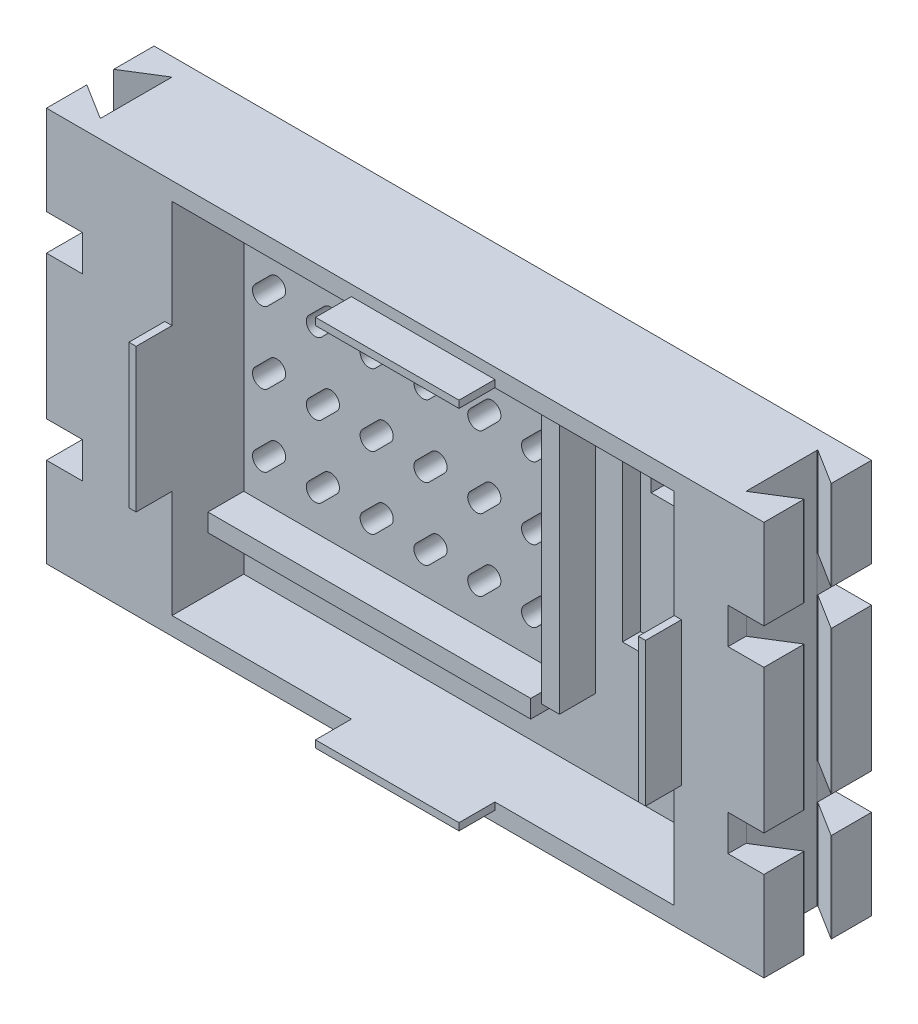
from build123d import *

# Parameters (mm, degrees)
SKETCH1_W            = 150
SKETCH1_H            = 110
BOSS_EXTRUDE1_DEPTH  = 30
SKETCH2_W            = 140
SKETCH2_H            = 100
CUT_EXTRUDE1_DEPTH   = 20
SKETCH3_W            = 90
SKETCH3_H            = 5
BOSS_EXTRUDE3_DEPTH  = 10
SKETCH4_W            = 5
SKETCH4_H            = 79.839205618
BOSS_EXTRUDE4_DEPTH  = 10
CUT_EXTRUDE3_DEPTH   = 30
SKETCH6_W            = 30
SKETCH6_H            = 110
BOSS_EXTRUDE5_DEPTH  = 20
CUT_EXTRUDE4_DEPTH   = 160
SKETCH8_W            = 30
SKETCH8_H            = 110
BOSS_EXTRUDE6_DEPTH  = 30
CUT_EXTRUDE5_DEPTH   = 120
FILLET5_R            = 0.1
FILLET6_R            = 0.1
FILLET7_R            = 0.1
FILLET8_R            = 0.1
SKETCH21_W           = 25.5
SKETCH21_H           = 25
CUT_EXTRUDE10_DEPTH  = 5
SKETCH22_W           = 19.5
SKETCH22_H           = 25
CUT_EXTRUDE11_DEPTH  = 5
SKETCH23_W           = 21.5
SKETCH23_H           = 35
CUT_EXTRUDE12_DEPTH  = 5
SKETCH28_W           = 40
SKETCH28_H           = 2
BOSS_EXTRUDE8_DEPTH  = 10
SKETCH29_W           = 2
SKETCH29_H           = 40
BOSS_EXTRUDE9_DEPTH  = 10
SKETCH30_W           = 25.5
SKETCH30_H           = 60
CUT_EXTRUDE13_DEPTH  = 5
SKETCH32_W           = 3.5
SKETCH32_H           = 4
BOSS_EXTRUDE10_DEPTH = 2.5
SKETCH33_W           = 3.5
SKETCH33_H           = 4
BOSS_EXTRUDE11_DEPTH = 2.5
SKETCH34_W           = 10
SKETCH34_H           = 10
CUT_EXTRUDE14_DEPTH  = 42.5
SKETCH35_W           = 10
SKETCH35_H           = 10
CUT_EXTRUDE15_DEPTH  = 42.5


with BuildPart() as part:
    # Sketch1 → Boss-Extrude1 (new body)
    with BuildSketch(Plane.XY):
        with Locations((75, -55)):
            Rectangle(SKETCH1_W, SKETCH1_H)
    extrude(amount=BOSS_EXTRUDE1_DEPTH)

    # Sketch2 → Cut-Extrude1 (cut)
    with BuildSketch(Plane.XY.offset(30)):
        with Locations((75, -55)):
            Rectangle(SKETCH2_W, SKETCH2_H)
    extrude(amount=-CUT_EXTRUDE1_DEPTH, mode=Mode.SUBTRACT)

    # Sketch3 → Boss-Extrude3 (add)
    with BuildSketch(Plane.XY.offset(10)):
        with Locations((50, -87.5)):
            Rectangle(SKETCH3_W, SKETCH3_H)
    extrude(amount=BOSS_EXTRUDE3_DEPTH)

    # Sketch4 → Boss-Extrude4 (add)
    with BuildSketch(Plane.XY.offset(10)):
        with Locations((100.5, -44.919602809)):
            Rectangle(SKETCH4_W, SKETCH4_H)
    extrude(amount=BOSS_EXTRUDE4_DEPTH)

    # Sketch5 → Cut-Extrude3 (cut)
    with BuildSketch(Plane.XY.offset(10)):
        with BuildLine():
            Line((8.162282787, -13.401513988), (12.404923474, -9.158873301))
            ThreePointArc((12.404923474, -9.158873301), (15.94045738, -9.158873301), (15.94045738, -12.694407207))
            Line((15.94045738, -12.694407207), (11.697816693, -16.937047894))
            ThreePointArc((11.697816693, -16.937047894), (8.162282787, -16.937047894), (8.162282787, -13.401513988))
        make_face()
        with BuildLine():
            Line((23.162282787, -13.401513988), (27.404923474, -9.158873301))
            ThreePointArc((27.404923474, -9.158873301), (30.94045738, -9.158873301), (30.94045738, -12.694407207))
            Line((30.94045738, -12.694407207), (26.697816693, -16.937047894))
            ThreePointArc((26.697816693, -16.937047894), (23.162282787, -16.937047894), (23.162282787, -13.401513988))
        make_face()
        with BuildLine():
            Line((38.162282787, -13.401513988), (42.404923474, -9.158873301))
            ThreePointArc((42.404923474, -9.158873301), (45.94045738, -9.158873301), (45.94045738, -12.694407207))
            Line((45.94045738, -12.694407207), (41.697816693, -16.937047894))
            ThreePointArc((41.697816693, -16.937047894), (38.162282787, -16.937047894), (38.162282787, -13.401513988))
        make_face()
        with BuildLine():
            Line((53.162282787, -13.401513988), (57.404923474, -9.158873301))
            ThreePointArc((57.404923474, -9.158873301), (60.94045738, -9.158873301), (60.94045738, -12.694407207))
            Line((60.94045738, -12.694407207), (56.697816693, -16.937047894))
            ThreePointArc((56.697816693, -16.937047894), (53.162282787, -16.937047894), (53.162282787, -13.401513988))
        make_face()
        with BuildLine():
            Line((68.162282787, -13.401513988), (72.404923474, -9.158873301))
            ThreePointArc((72.404923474, -9.158873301), (75.94045738, -9.158873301), (75.94045738, -12.694407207))
            Line((75.94045738, -12.694407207), (71.697816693, -16.937047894))
            ThreePointArc((71.697816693, -16.937047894), (68.162282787, -16.937047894), (68.162282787, -13.401513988))
        make_face()
        with BuildLine():
            Line((83.162282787, -13.401513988), (87.404923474, -9.158873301))
            ThreePointArc((87.404923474, -9.158873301), (90.94045738, -9.158873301), (90.94045738, -12.694407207))
            Line((90.94045738, -12.694407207), (86.697816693, -16.937047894))
            ThreePointArc((86.697816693, -16.937047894), (83.162282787, -16.937047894), (83.162282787, -13.401513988))
        make_face()
        with BuildLine():
            Line((23.162282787, -33.401513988), (27.404923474, -29.158873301))
            ThreePointArc((27.404923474, -29.158873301), (30.94045738, -29.158873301), (30.94045738, -32.694407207))
            Line((30.94045738, -32.694407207), (26.697816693, -36.937047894))
            ThreePointArc((26.697816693, -36.937047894), (23.162282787, -36.937047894), (23.162282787, -33.401513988))
        make_face()
        with BuildLine():
            Line((38.162282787, -33.401513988), (42.404923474, -29.158873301))
            ThreePointArc((42.404923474, -29.158873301), (45.94045738, -29.158873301), (45.94045738, -32.694407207))
            Line((45.94045738, -32.694407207), (41.697816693, -36.937047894))
            ThreePointArc((41.697816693, -36.937047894), (38.162282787, -36.937047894), (38.162282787, -33.401513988))
        make_face()
        with BuildLine():
            Line((53.162282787, -33.401513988), (57.404923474, -29.158873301))
            ThreePointArc((57.404923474, -29.158873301), (60.94045738, -29.158873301), (60.94045738, -32.694407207))
            Line((60.94045738, -32.694407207), (56.697816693, -36.937047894))
            ThreePointArc((56.697816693, -36.937047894), (53.162282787, -36.937047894), (53.162282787, -33.401513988))
        make_face()
        with BuildLine():
            Line((68.162282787, -33.401513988), (72.404923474, -29.158873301))
            ThreePointArc((72.404923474, -29.158873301), (75.94045738, -29.158873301), (75.94045738, -32.694407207))
            Line((75.94045738, -32.694407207), (71.697816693, -36.937047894))
            ThreePointArc((71.697816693, -36.937047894), (68.162282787, -36.937047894), (68.162282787, -33.401513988))
        make_face()
        with BuildLine():
            Line((83.162282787, -33.401513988), (87.404923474, -29.158873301))
            ThreePointArc((87.404923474, -29.158873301), (90.94045738, -29.158873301), (90.94045738, -32.694407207))
            Line((90.94045738, -32.694407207), (86.697816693, -36.937047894))
            ThreePointArc((86.697816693, -36.937047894), (83.162282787, -36.937047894), (83.162282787, -33.401513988))
        make_face()
        with BuildLine():
            Line((23.162282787, -53.401513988), (27.404923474, -49.158873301))
            ThreePointArc((27.404923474, -49.158873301), (30.94045738, -49.158873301), (30.94045738, -52.694407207))
            Line((30.94045738, -52.694407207), (26.697816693, -56.937047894))
            ThreePointArc((26.697816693, -56.937047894), (23.162282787, -56.937047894), (23.162282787, -53.401513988))
        make_face()
        with BuildLine():
            Line((38.162282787, -53.401513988), (42.404923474, -49.158873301))
            ThreePointArc((42.404923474, -49.158873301), (45.94045738, -49.158873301), (45.94045738, -52.694407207))
            Line((45.94045738, -52.694407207), (41.697816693, -56.937047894))
            ThreePointArc((41.697816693, -56.937047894), (38.162282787, -56.937047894), (38.162282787, -53.401513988))
        make_face()
        with BuildLine():
            Line((53.162282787, -53.401513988), (57.404923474, -49.158873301))
            ThreePointArc((57.404923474, -49.158873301), (60.94045738, -49.158873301), (60.94045738, -52.694407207))
            Line((60.94045738, -52.694407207), (56.697816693, -56.937047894))
            ThreePointArc((56.697816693, -56.937047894), (53.162282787, -56.937047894), (53.162282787, -53.401513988))
        make_face()
        with BuildLine():
            Line((68.162282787, -53.401513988), (72.404923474, -49.158873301))
            ThreePointArc((72.404923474, -49.158873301), (75.94045738, -49.158873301), (75.94045738, -52.694407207))
            Line((75.94045738, -52.694407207), (71.697816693, -56.937047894))
            ThreePointArc((71.697816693, -56.937047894), (68.162282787, -56.937047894), (68.162282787, -53.401513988))
        make_face()
        with BuildLine():
            Line((83.162282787, -53.401513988), (87.404923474, -49.158873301))
            ThreePointArc((87.404923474, -49.158873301), (90.94045738, -49.158873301), (90.94045738, -52.694407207))
            Line((90.94045738, -52.694407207), (86.697816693, -56.937047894))
            ThreePointArc((86.697816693, -56.937047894), (83.162282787, -56.937047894), (83.162282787, -53.401513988))
        make_face()
        with BuildLine():
            Line((23.162282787, -73.401513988), (27.404923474, -69.158873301))
            ThreePointArc((27.404923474, -69.158873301), (30.94045738, -69.158873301), (30.94045738, -72.694407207))
            Line((30.94045738, -72.694407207), (26.697816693, -76.937047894))
            ThreePointArc((26.697816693, -76.937047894), (23.162282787, -76.937047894), (23.162282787, -73.401513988))
        make_face()
        with BuildLine():
            Line((38.162282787, -73.401513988), (42.404923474, -69.158873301))
            ThreePointArc((42.404923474, -69.158873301), (45.94045738, -69.158873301), (45.94045738, -72.694407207))
            Line((45.94045738, -72.694407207), (41.697816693, -76.937047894))
            ThreePointArc((41.697816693, -76.937047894), (38.162282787, -76.937047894), (38.162282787, -73.401513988))
        make_face()
        with BuildLine():
            Line((53.162282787, -73.401513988), (57.404923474, -69.158873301))
            ThreePointArc((57.404923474, -69.158873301), (60.94045738, -69.158873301), (60.94045738, -72.694407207))
            Line((60.94045738, -72.694407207), (56.697816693, -76.937047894))
            ThreePointArc((56.697816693, -76.937047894), (53.162282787, -76.937047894), (53.162282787, -73.401513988))
        make_face()
        with BuildLine():
            Line((68.162282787, -73.401513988), (72.404923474, -69.158873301))
            ThreePointArc((72.404923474, -69.158873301), (75.94045738, -69.158873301), (75.94045738, -72.694407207))
            Line((75.94045738, -72.694407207), (71.697816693, -76.937047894))
            ThreePointArc((71.697816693, -76.937047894), (68.162282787, -76.937047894), (68.162282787, -73.401513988))
        make_face()
        with BuildLine():
            Line((83.162282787, -73.401513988), (87.404923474, -69.158873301))
            ThreePointArc((87.404923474, -69.158873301), (90.94045738, -69.158873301), (90.94045738, -72.694407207))
            Line((90.94045738, -72.694407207), (86.697816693, -76.937047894))
            ThreePointArc((86.697816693, -76.937047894), (83.162282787, -76.937047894), (83.162282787, -73.401513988))
        make_face()
        with BuildLine():
            Line((8.162282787, -33.401513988), (12.404923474, -29.158873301))
            ThreePointArc((12.404923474, -29.158873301), (15.94045738, -29.158873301), (15.94045738, -32.694407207))
            Line((15.94045738, -32.694407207), (11.697816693, -36.937047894))
            ThreePointArc((11.697816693, -36.937047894), (8.162282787, -36.937047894), (8.162282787, -33.401513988))
        make_face()
        with BuildLine():
            Line((8.162282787, -53.401513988), (12.404923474, -49.158873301))
            ThreePointArc((12.404923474, -49.158873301), (15.94045738, -49.158873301), (15.94045738, -52.694407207))
            Line((15.94045738, -52.694407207), (11.697816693, -56.937047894))
            ThreePointArc((11.697816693, -56.937047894), (8.162282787, -56.937047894), (8.162282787, -53.401513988))
        make_face()
        with BuildLine():
            Line((8.162282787, -73.401513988), (12.404923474, -69.158873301))
            ThreePointArc((12.404923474, -69.158873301), (15.94045738, -69.158873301), (15.94045738, -72.694407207))
            Line((15.94045738, -72.694407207), (11.697816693, -76.937047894))
            ThreePointArc((11.697816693, -76.937047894), (8.162282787, -76.937047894), (8.162282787, -73.401513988))
        make_face()
    extrude(amount=-CUT_EXTRUDE3_DEPTH, mode=Mode.SUBTRACT)

    # Sketch6 → Boss-Extrude5 (add)
    with BuildSketch(Plane(origin=(150, 0, 0), x_dir=(0, 0, -1), z_dir=(1, 0, 0))):
        with Locations((-15, -55)):
            Rectangle(SKETCH6_W, SKETCH6_H)
    extrude(amount=BOSS_EXTRUDE5_DEPTH)

    # Sketch7 → Cut-Extrude4 (cut)
    with BuildSketch(Plane.XZ.offset(110)):
        Polygon((170, 18.75), (159.997909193, 25), (159.997909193, 5), (170, 11.25), align=None)
    extrude(amount=-CUT_EXTRUDE4_DEPTH, mode=Mode.SUBTRACT)

    # Sketch8 → Boss-Extrude6 (add)
    with BuildSketch(Plane.ZY):
        with Locations((15, -55)):
            Rectangle(SKETCH8_W, SKETCH8_H)
    extrude(amount=BOSS_EXTRUDE6_DEPTH)

    # Sketch9 → Cut-Extrude5 (cut)
    with BuildSketch(Plane.XZ.offset(110)):
        Polygon((-30, 11.25), (-30, 18.75), (-19.997909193, 25), (-19.997909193, 5), align=None)
    extrude(amount=-CUT_EXTRUDE5_DEPTH, mode=Mode.SUBTRACT)

    # Fillet5
    fillet5_edges = [part.edges().sort_by_distance(p)[0] for p in [
        (-19.997909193, -55, 5),
    ]]
    fillet(fillet5_edges, radius=FILLET5_R)

    # Fillet6
    fillet6_edges = [part.edges().sort_by_distance(p)[0] for p in [
        (-19.997909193, -55, 25),
    ]]
    fillet(fillet6_edges, radius=FILLET6_R)

    # Fillet7
    fillet7_edges = [part.edges().sort_by_distance(p)[0] for p in [
        (159.997909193, -55, 5),
        (159.997909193, -55, 25),
    ]]
    fillet(fillet7_edges, radius=FILLET7_R)

    # Fillet8
    fillet8_edges = [part.edges().sort_by_distance(p)[0] for p in [
        (170, -55, 18.75),
        (170, -55, 11.25),
    ]]
    fillet(fillet8_edges, radius=FILLET8_R)

    # Sketch21 → Cut-Extrude10 (cut)
    with BuildSketch(Plane.XY.offset(10)):
        with Locations((123.308603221, -21.083663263)):
            Rectangle(SKETCH21_W, SKETCH21_H)
    extrude(amount=-CUT_EXTRUDE10_DEPTH, mode=Mode.SUBTRACT)

    # Sketch22 → Cut-Extrude11 (cut)
    with BuildSketch(Plane.XY.offset(5)):
        with Locations((123.308603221, -21.083663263)):
            Rectangle(SKETCH22_W, SKETCH22_H)
    extrude(amount=-CUT_EXTRUDE11_DEPTH, mode=Mode.SUBTRACT)

    # Sketch23 → Cut-Extrude12 (cut)
    with BuildSketch(Plane.XY.offset(10)):
        with Locations((123.308603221, -51.083663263)):
            Rectangle(SKETCH23_W, SKETCH23_H)
    extrude(amount=-CUT_EXTRUDE12_DEPTH, mode=Mode.SUBTRACT)

    # Sketch28 → Boss-Extrude8 (add)
    with BuildSketch(Plane.XY.offset(30)):
        with Locations((75, -4)):
            Rectangle(SKETCH28_W, SKETCH28_H)
        with Locations((75, -106)):
            Rectangle(SKETCH28_W, SKETCH28_H)
    extrude(amount=BOSS_EXTRUDE8_DEPTH)

    # Sketch29 → Boss-Extrude9 (add)
    with BuildSketch(Plane.XY.offset(30)):
        with Locations((4, -55)):
            Rectangle(SKETCH29_W, SKETCH29_H)
        with Locations((146, -55)):
            Rectangle(SKETCH29_W, SKETCH29_H)
    extrude(amount=BOSS_EXTRUDE9_DEPTH)

    # Sketch30 → Cut-Extrude13 (cut)
    with BuildSketch(Plane.XY.offset(10)):
        with Locations((123.308603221, -38.583663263)):
            Rectangle(SKETCH30_W, SKETCH30_H)
    extrude(amount=-CUT_EXTRUDE13_DEPTH, mode=Mode.SUBTRACT)

    # Sketch32 → Boss-Extrude10 (add)
    with BuildSketch(Plane(origin=(110.558603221, 0, 0), x_dir=(0, 0, -1), z_dir=(1, 0, 0))):
        with Locations((-8.25, -10.583663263)):
            Rectangle(SKETCH32_W, SKETCH32_H)
    extrude(amount=BOSS_EXTRUDE10_DEPTH)

    # Sketch33 → Boss-Extrude11 (add)
    with BuildSketch(Plane.ZY.offset(-136.058603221)):
        with Locations((8.25, -10.583663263)):
            Rectangle(SKETCH33_W, SKETCH33_H)
    extrude(amount=BOSS_EXTRUDE11_DEPTH)

    # Sketch34 → Cut-Extrude14 (cut)
    with BuildSketch(Plane.XY.offset(30)):
        with Locations((-25, -80)):
            Rectangle(SKETCH34_W, SKETCH34_H)
        with Locations((-25, -30)):
            Rectangle(SKETCH34_W, SKETCH34_H)
    extrude(amount=-CUT_EXTRUDE14_DEPTH, mode=Mode.SUBTRACT)

    # Sketch35 → Cut-Extrude15 (cut)
    with BuildSketch(Plane.XY.offset(30)):
        with Locations((165, -80)):
            Rectangle(SKETCH35_W, SKETCH35_H)
        with Locations((165, -30)):
            Rectangle(SKETCH35_W, SKETCH35_H)
    extrude(amount=-CUT_EXTRUDE15_DEPTH, mode=Mode.SUBTRACT)


solid = part.part
